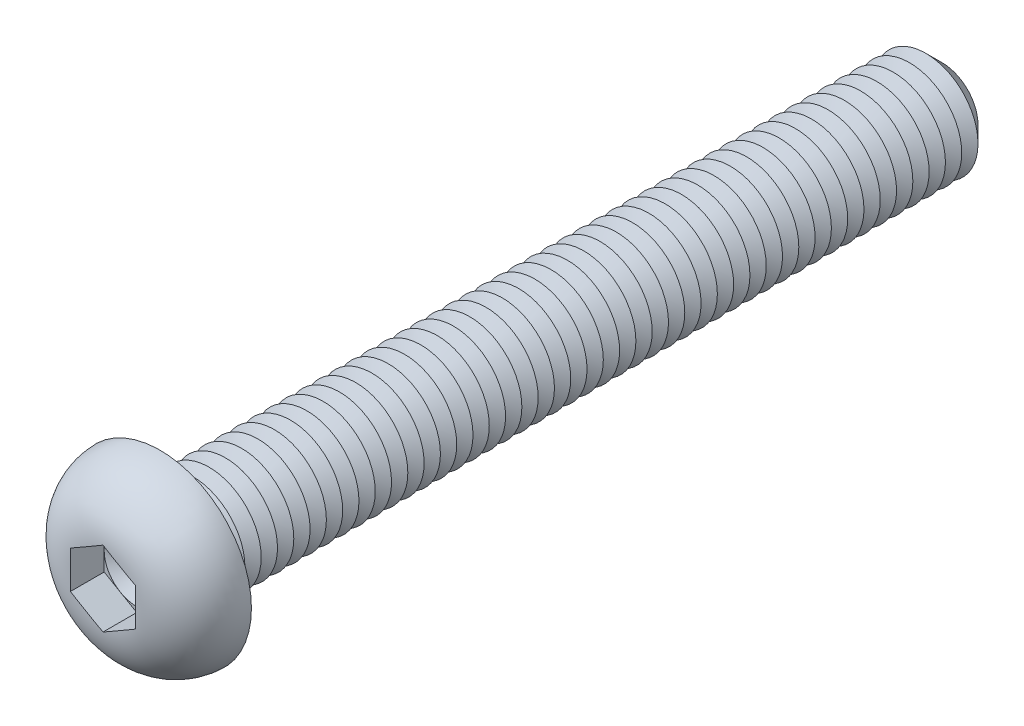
from build123d import *

# Parameters (mm, degrees)
CUT_EXTRUDE1_DEPTH  = 2.6
SKETCH4_R           = 4
BOSS_EXTRUDE1_DEPTH = 60
CHAMFER1_SIZE       = 1.25
LPATTERN1_COUNT     = 46
LPATTERN1_PITCH     = 1.25
FILLET2_R           = 0.5


with BuildPart() as part:
    # Sketch2 → Revolve1 (revolve)
    with BuildSketch(Plane(origin=(0, 0, 0), x_dir=(0, 0, -1), z_dir=(1, 0, 0)), mode=Mode.PRIVATE) as revolve1_sk:
        with BuildLine():
            Line((0, 0), (-4.4, 0))
            Line((-4.4, 0), (-4.4, 2.501111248))
            ThreePointArc((-4.4, 2.501111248), (-3.117141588, 5.647537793), (0, 7))
            Line((0, 7), (0, 0))
        make_face()
    revolve(revolve1_sk.sketch.rotate(Axis((0, 0, 47.934239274), (0, 0, -1)), 90), axis=Axis((0, 0, 47.934239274), (0, 0, -1)))

    # Sketch3 → Cut-Extrude1 (cut)
    with BuildSketch(Plane.XY.offset(4.4)):
        Polygon((0, 2.886751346), (-2.5, 1.443375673), (-2.5, -1.443375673), (0, -2.886751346), (2.5, -1.443375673), (2.5, 1.443375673), align=None)
    extrude(amount=-CUT_EXTRUDE1_DEPTH, mode=Mode.SUBTRACT)

    # Sketch4 → Boss-Extrude1 (add)
    with BuildSketch(Plane(origin=(0, 0, 0), x_dir=(-1, 0, 0), z_dir=(0, 0, -1))):
        with Locations(Location((0, 0, 0), (0, 0, 180))):
            Circle(SKETCH4_R)
    extrude(amount=BOSS_EXTRUDE1_DEPTH)

    # Chamfer1
    chamfer1_edges = [part.edges().sort_by_distance(p)[0] for p in [
        (-4, 0, -60),
    ]]
    chamfer(chamfer1_edges, length=CHAMFER1_SIZE)

    # Sketch5 → Cut-Revolve1 (revolve, cut)
    with BuildSketch(Plane(origin=(0, 0, 0), x_dir=(0, 0, -1), z_dir=(1, 0, 0)), mode=Mode.PRIVATE) as cut_revolve1_sk:
        Polygon((1.25, 4), (2.5, 4), (1.875, 2.917468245), align=None)
    cut_revolve1 = revolve(cut_revolve1_sk.sketch.rotate(Axis((0, 0, 47.934239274), (0, 0, -1)), 90), axis=Axis((0, 0, 47.934239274), (0, 0, -1)), mode=Mode.SUBTRACT)

    # LPattern1: Cut-Revolve1 ×46
    with Locations(*[(0, 0, -i * LPATTERN1_PITCH) for i in range(1, LPATTERN1_COUNT)]):
        add(cut_revolve1, mode=Mode.SUBTRACT)

    # Fillet2
    fillet2_edges = [part.edges().sort_by_distance(p)[0] for p in [
        (-4, 0, 0),
    ]]
    fillet(fillet2_edges, radius=FILLET2_R)

    # Cut-Extrude2 cone 1 section (on through the dimple's axis) → Cut-Extrude2 (revolve, cut)
    with BuildSketch(Plane(origin=(0, 0, 1.8), x_dir=(0, -1, 0), z_dir=(1, 0, 0))):
        Polygon((0, 0), (2.5, 0), (0, 1.443375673), align=None)
    revolve(axis=Axis((0, 0, 1.8), (0, 0, -1)), mode=Mode.SUBTRACT)


solid = part.part
